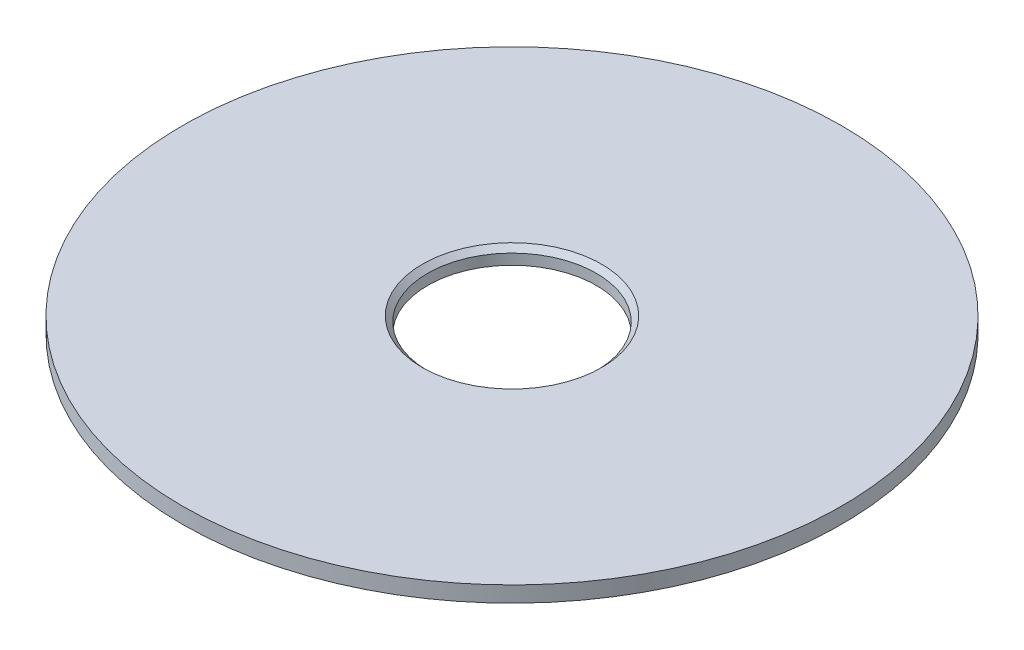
from build123d import *

# Parameters (mm, degrees)
SKETCH1_R           = 31.25
SKETCH1_R_2         = 8
BOSS_EXTRUDE1_DEPTH = 1.5
CHAMFER1_SIZE       = 0.5


with BuildPart() as part:
    # Sketch1 → Boss-Extrude1 (new body)
    with BuildSketch(Plane(origin=(0, 0, 0), x_dir=(1, 0, 0), z_dir=(0, 1, 0))):
        with Locations(Location((0, 0, 0), (0, 0, 270))):
            Circle(SKETCH1_R)
        with Locations(Location((0, 0, 0), (0, 0, 270))):
            Circle(SKETCH1_R_2, mode=Mode.SUBTRACT)
    extrude(amount=-BOSS_EXTRUDE1_DEPTH)

    # Chamfer1
    chamfer1_edges = [part.edges().sort_by_distance(p)[0] for p in [
        (0, 0, -8),
    ]]
    chamfer(chamfer1_edges, length=CHAMFER1_SIZE)


solid = part.part
